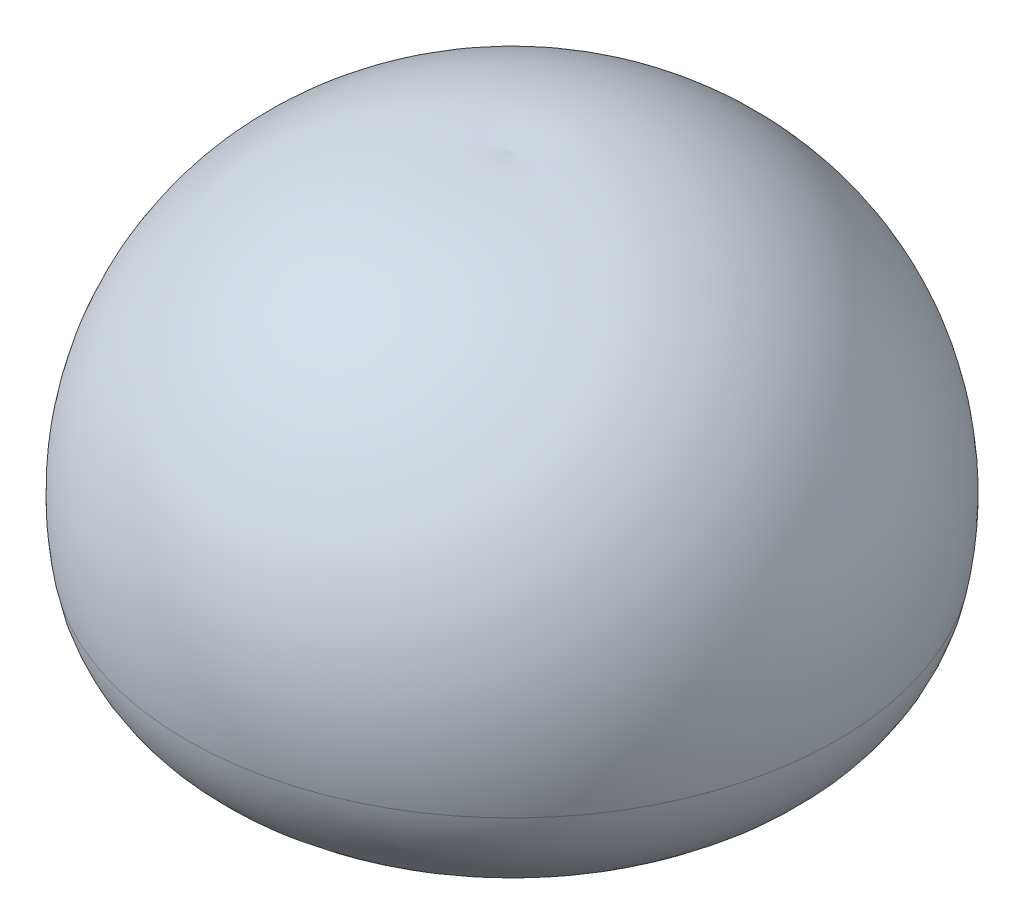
from build123d import *


with BuildPart() as part:
    # Sketch 1 → Revolve 1 (revolve)
    with BuildSketch(Plane.XY, mode=Mode.PRIVATE) as revolve_1_sk:
        with BuildLine():
            Line((0, 1095.574991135), (0, 2901.664859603))
            ThreePointArc((0, 2901.664859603), (1932.478023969, 2185.683834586), (2519.749310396, 210.281957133))
            ThreePointArc((2519.749310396, 210.281957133), (1453.219575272, -726.285834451), (306.906741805, 110.739727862))
            ThreePointArc((306.906741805, 110.739727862), (732.286038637, 753.324661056), (25.597074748, 1060.657787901))
            ThreePointArc((25.597074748, 1060.657787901), (12.965076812, 1078.238476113), (0, 1095.574991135))
        make_face()
    revolve(revolve_1_sk.sketch.rotate(Axis((0, 0, 0), (0, 1, 0)), 90), axis=Axis((0, 0, 0), (0, 1, 0)))


solid = part.part
